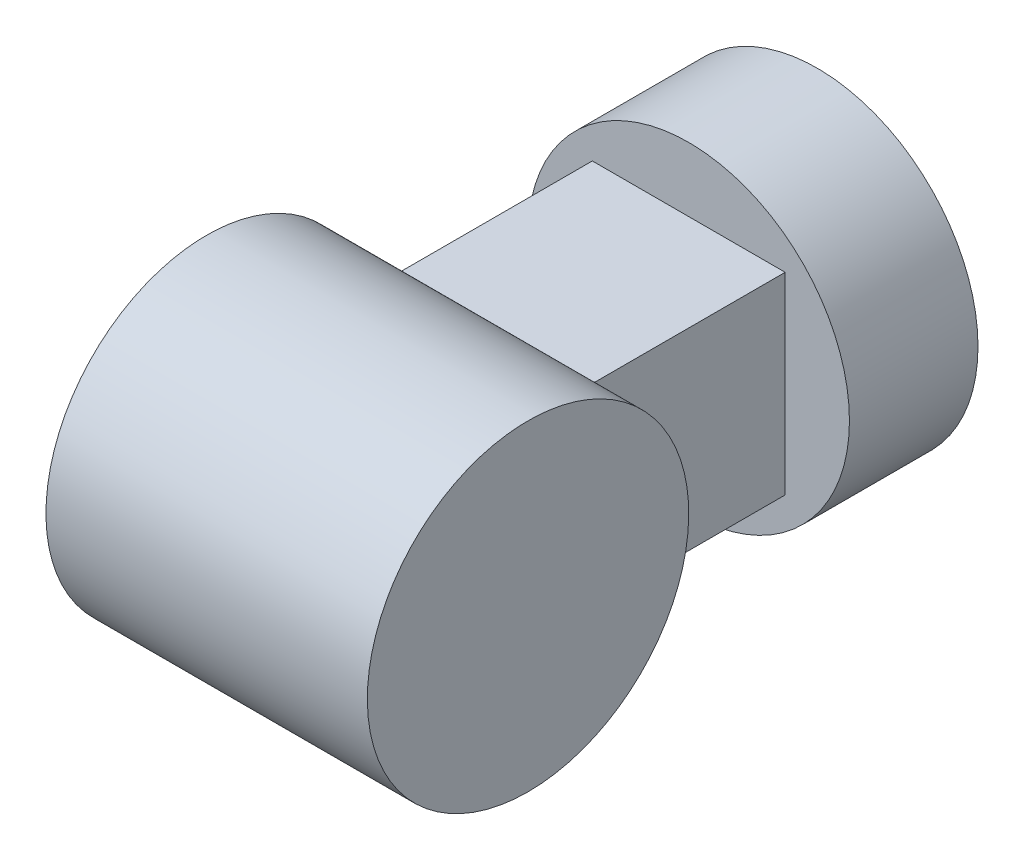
ISO-10303-21;
HEADER;
FILE_DESCRIPTION(('STEP AP214'),'2;1');
FILE_NAME('part.step','',(''),(''),'','','');
FILE_SCHEMA(('AUTOMOTIVE_DESIGN { 1 0 10303 214 1 1 1 1 }'));
ENDSEC;
DATA;
#1=APPLICATION_CONTEXT('core data for automotive mechanical design processes');
#2=APPLICATION_PROTOCOL_DEFINITION('international standard','automotive_design',2000,#1);
#3=PRODUCT_CONTEXT('',#1,'mechanical');
#4=PRODUCT('Part','Part','',(#3));
#5=PRODUCT_RELATED_PRODUCT_CATEGORY('part','',(#4));
#6=PRODUCT_DEFINITION_FORMATION('','',#4);
#7=PRODUCT_DEFINITION_CONTEXT('part definition',#1,'design');
#8=PRODUCT_DEFINITION('design','',#6,#7);
#9=PRODUCT_DEFINITION_SHAPE('','',#8);
#10=(LENGTH_UNIT() NAMED_UNIT(*) SI_UNIT(.MILLI.,.METRE.));
#11=(NAMED_UNIT(*) PLANE_ANGLE_UNIT() SI_UNIT($,.RADIAN.));
#12=(NAMED_UNIT(*) SI_UNIT($,.STERADIAN.) SOLID_ANGLE_UNIT());
#13=UNCERTAINTY_MEASURE_WITH_UNIT(LENGTH_MEASURE(1.E-05),#10,'distance_accuracy_value','');
#14=(GEOMETRIC_REPRESENTATION_CONTEXT(3) GLOBAL_UNCERTAINTY_ASSIGNED_CONTEXT((#13)) GLOBAL_UNIT_ASSIGNED_CONTEXT((#10,
#11,#12)) REPRESENTATION_CONTEXT('',''));
#15=CARTESIAN_POINT('',(0.,0.,0.));
#16=DIRECTION('',(0.,0.,1.));
#17=DIRECTION('',(1.,0.,0.));
#18=AXIS2_PLACEMENT_3D('',#15,#16,#17);
#19=CARTESIAN_POINT('',(0.,0.,100.));
#20=DIRECTION('',(0.,0.,-1.));
#21=DIRECTION('',(-1.,0.,0.));
#22=AXIS2_PLACEMENT_3D('',#19,#20,#21);
#23=CYLINDRICAL_SURFACE('',#22,125.);
#24=CARTESIAN_POINT('',(0.,0.,100.));
#25=DIRECTION('',(0.,0.,1.));
#26=DIRECTION('',(1.,0.,0.));
#27=AXIS2_PLACEMENT_3D('',#24,#25,#26);
#28=CIRCLE('',#27,125.);
#29=CARTESIAN_POINT('',(125.,0.,100.));
#30=VERTEX_POINT('',#29);
#31=EDGE_CURVE('E44',#30,#30,#28,.T.);
#32=ORIENTED_EDGE('',*,*,#31,.F.);
#33=EDGE_LOOP('',(#32));
#34=FACE_BOUND('',#33,.T.);
#35=CARTESIAN_POINT('',(0.,0.,0.));
#36=DIRECTION('',(0.,0.,1.));
#37=DIRECTION('',(1.,0.,0.));
#38=AXIS2_PLACEMENT_3D('',#35,#36,#37);
#39=CIRCLE('',#38,125.);
#40=CARTESIAN_POINT('',(125.,0.,0.));
#41=VERTEX_POINT('',#40);
#42=EDGE_CURVE('E100',#41,#41,#39,.T.);
#43=ORIENTED_EDGE('',*,*,#42,.T.);
#44=EDGE_LOOP('',(#43));
#45=FACE_BOUND('',#44,.T.);
#46=ADVANCED_FACE('F37',(#34,#45),#23,.T.);
#47=CARTESIAN_POINT('',(0.,0.,100.));
#48=DIRECTION('',(0.,0.,1.));
#49=DIRECTION('',(1.,0.,0.));
#50=AXIS2_PLACEMENT_3D('',#47,#48,#49);
#51=PLANE('',#50);
#52=DIRECTION('',(0.,1.,0.));
#53=VECTOR('',#52,1.);
#54=CARTESIAN_POINT('',(75.,-75.,100.));
#55=LINE('',#54,#53);
#56=CARTESIAN_POINT('',(75.,-75.,100.));
#57=VERTEX_POINT('',#56);
#58=CARTESIAN_POINT('',(75.,75.,100.));
#59=VERTEX_POINT('',#58);
#60=EDGE_CURVE('E83',#57,#59,#55,.T.);
#61=ORIENTED_EDGE('',*,*,#60,.F.);
#62=DIRECTION('',(1.,0.,0.));
#63=VECTOR('',#62,1.);
#64=CARTESIAN_POINT('',(75.,-75.,100.));
#65=LINE('',#64,#63);
#66=CARTESIAN_POINT('',(-75.,-75.,100.));
#67=VERTEX_POINT('',#66);
#68=EDGE_CURVE('E89',#67,#57,#65,.T.);
#69=ORIENTED_EDGE('',*,*,#68,.F.);
#70=DIRECTION('',(0.,-1.,0.));
#71=VECTOR('',#70,1.);
#72=CARTESIAN_POINT('',(-75.,-75.,100.));
#73=LINE('',#72,#71);
#74=CARTESIAN_POINT('',(-75.,75.,100.));
#75=VERTEX_POINT('',#74);
#76=EDGE_CURVE('E94',#75,#67,#73,.T.);
#77=ORIENTED_EDGE('',*,*,#76,.F.);
#78=DIRECTION('',(-1.,0.,0.));
#79=VECTOR('',#78,1.);
#80=CARTESIAN_POINT('',(75.,75.,100.));
#81=LINE('',#80,#79);
#82=EDGE_CURVE('E206',#59,#75,#81,.T.);
#83=ORIENTED_EDGE('',*,*,#82,.F.);
#84=EDGE_LOOP('',(#61,#69,#77,#83));
#85=FACE_BOUND('',#84,.T.);
#86=ORIENTED_EDGE('',*,*,#31,.T.);
#87=EDGE_LOOP('',(#86));
#88=FACE_BOUND('',#87,.T.);
#89=ADVANCED_FACE('F108',(#85,#88),#51,.T.);
#90=CARTESIAN_POINT('',(0.,0.,0.));
#91=DIRECTION('',(0.,0.,1.));
#92=DIRECTION('',(1.,0.,0.));
#93=AXIS2_PLACEMENT_3D('',#90,#91,#92);
#94=PLANE('',#93);
#95=ORIENTED_EDGE('',*,*,#42,.F.);
#96=EDGE_LOOP('',(#95));
#97=FACE_BOUND('',#96,.T.);
#98=ADVANCED_FACE('F106',(#97),#94,.F.);
#99=CARTESIAN_POINT('',(75.,-75.,350.));
#100=DIRECTION('',(-1.,0.,0.));
#101=DIRECTION('',(0.,0.,1.));
#102=AXIS2_PLACEMENT_3D('',#99,#100,#101);
#103=PLANE('',#102);
#104=DIRECTION('',(0.,0.,-1.));
#105=VECTOR('',#104,1.);
#106=CARTESIAN_POINT('',(75.,75.,350.));
#107=LINE('',#106,#105);
#108=CARTESIAN_POINT('',(75.,75.,250.));
#109=VERTEX_POINT('',#108);
#110=EDGE_CURVE('E82',#109,#59,#107,.T.);
#111=ORIENTED_EDGE('',*,*,#110,.F.);
#112=CARTESIAN_POINT('',(75.,0.,350.));
#113=DIRECTION('',(-1.,0.,0.));
#114=DIRECTION('',(0.,0.,1.));
#115=AXIS2_PLACEMENT_3D('',#112,#113,#114);
#116=CIRCLE('',#115,125.);
#117=CARTESIAN_POINT('',(75.,-75.,250.));
#118=VERTEX_POINT('',#117);
#119=EDGE_CURVE('E76',#109,#118,#116,.T.);
#120=ORIENTED_EDGE('',*,*,#119,.T.);
#121=DIRECTION('',(0.,0.,-1.));
#122=VECTOR('',#121,1.);
#123=CARTESIAN_POINT('',(75.,-75.,350.));
#124=LINE('',#123,#122);
#125=EDGE_CURVE('E58',#118,#57,#124,.T.);
#126=ORIENTED_EDGE('',*,*,#125,.T.);
#127=ORIENTED_EDGE('',*,*,#60,.T.);
#128=EDGE_LOOP('',(#111,#120,#126,#127));
#129=FACE_BOUND('',#128,.T.);
#130=ADVANCED_FACE('F81',(#129),#103,.F.);
#131=CARTESIAN_POINT('',(75.,75.,350.));
#132=DIRECTION('',(0.,-1.,0.));
#133=DIRECTION('',(1.,0.,0.));
#134=AXIS2_PLACEMENT_3D('',#131,#132,#133);
#135=PLANE('',#134);
#136=DIRECTION('',(0.,0.,-1.));
#137=VECTOR('',#136,1.);
#138=CARTESIAN_POINT('',(-75.,75.,350.));
#139=LINE('',#138,#137);
#140=CARTESIAN_POINT('',(-75.,75.,250.));
#141=VERTEX_POINT('',#140);
#142=EDGE_CURVE('E92',#141,#75,#139,.T.);
#143=ORIENTED_EDGE('',*,*,#142,.F.);
#144=DIRECTION('',(-1.,0.,0.));
#145=VECTOR('',#144,1.);
#146=CARTESIAN_POINT('',(125.,75.,250.));
#147=LINE('',#146,#145);
#148=EDGE_CURVE('E84',#141,#109,#147,.F.);
#149=ORIENTED_EDGE('',*,*,#148,.T.);
#150=ORIENTED_EDGE('',*,*,#110,.T.);
#151=ORIENTED_EDGE('',*,*,#82,.T.);
#152=EDGE_LOOP('',(#143,#149,#150,#151));
#153=FACE_BOUND('',#152,.T.);
#154=ADVANCED_FACE('F113',(#153),#135,.F.);
#155=CARTESIAN_POINT('',(-75.,-75.,350.));
#156=DIRECTION('',(1.,0.,0.));
#157=DIRECTION('',(0.,1.,0.));
#158=AXIS2_PLACEMENT_3D('',#155,#156,#157);
#159=PLANE('',#158);
#160=DIRECTION('',(0.,0.,-1.));
#161=VECTOR('',#160,1.);
#162=CARTESIAN_POINT('',(-75.,-75.,350.));
#163=LINE('',#162,#161);
#164=CARTESIAN_POINT('',(-75.,-75.,250.));
#165=VERTEX_POINT('',#164);
#166=EDGE_CURVE('E90',#165,#67,#163,.T.);
#167=ORIENTED_EDGE('',*,*,#166,.F.);
#168=CARTESIAN_POINT('',(-75.,0.,350.));
#169=DIRECTION('',(1.,0.,0.));
#170=DIRECTION('',(0.,1.,0.));
#171=AXIS2_PLACEMENT_3D('',#168,#169,#170);
#172=CIRCLE('',#171,125.);
#173=EDGE_CURVE('E51',#165,#141,#172,.T.);
#174=ORIENTED_EDGE('',*,*,#173,.T.);
#175=ORIENTED_EDGE('',*,*,#142,.T.);
#176=ORIENTED_EDGE('',*,*,#76,.T.);
#177=EDGE_LOOP('',(#167,#174,#175,#176));
#178=FACE_BOUND('',#177,.T.);
#179=ADVANCED_FACE('F144',(#178),#159,.F.);
#180=CARTESIAN_POINT('',(75.,-75.,350.));
#181=DIRECTION('',(0.,1.,0.));
#182=DIRECTION('',(-1.,0.,0.));
#183=AXIS2_PLACEMENT_3D('',#180,#181,#182);
#184=PLANE('',#183);
#185=ORIENTED_EDGE('',*,*,#125,.F.);
#186=DIRECTION('',(-1.,0.,0.));
#187=VECTOR('',#186,1.);
#188=CARTESIAN_POINT('',(125.,-75.,250.));
#189=LINE('',#188,#187);
#190=EDGE_CURVE('E11',#118,#165,#189,.T.);
#191=ORIENTED_EDGE('',*,*,#190,.T.);
#192=ORIENTED_EDGE('',*,*,#166,.T.);
#193=ORIENTED_EDGE('',*,*,#68,.T.);
#194=EDGE_LOOP('',(#185,#191,#192,#193));
#195=FACE_BOUND('',#194,.T.);
#196=ADVANCED_FACE('F87',(#195),#184,.F.);
#197=CARTESIAN_POINT('',(125.,0.,350.));
#198=DIRECTION('',(-1.,0.,0.));
#199=DIRECTION('',(0.,-1.,0.));
#200=AXIS2_PLACEMENT_3D('',#197,#198,#199);
#201=CYLINDRICAL_SURFACE('',#200,125.);
#202=CARTESIAN_POINT('',(-125.,0.,350.));
#203=DIRECTION('',(-1.,0.,0.));
#204=DIRECTION('',(0.,-1.,0.));
#205=AXIS2_PLACEMENT_3D('',#202,#203,#204);
#206=CIRCLE('',#205,125.);
#207=CARTESIAN_POINT('',(-125.,-125.,350.));
#208=VERTEX_POINT('',#207);
#209=EDGE_CURVE('E197',#208,#208,#206,.T.);
#210=ORIENTED_EDGE('',*,*,#209,.F.);
#211=EDGE_LOOP('',(#210));
#212=FACE_BOUND('',#211,.T.);
#213=CARTESIAN_POINT('',(125.,0.,350.));
#214=DIRECTION('',(-1.,0.,0.));
#215=DIRECTION('',(0.,-1.,0.));
#216=AXIS2_PLACEMENT_3D('',#213,#214,#215);
#217=CIRCLE('',#216,125.);
#218=CARTESIAN_POINT('',(125.,-125.,350.));
#219=VERTEX_POINT('',#218);
#220=EDGE_CURVE('E198',#219,#219,#217,.T.);
#221=ORIENTED_EDGE('',*,*,#220,.T.);
#222=EDGE_LOOP('',(#221));
#223=FACE_BOUND('',#222,.T.);
#224=ORIENTED_EDGE('',*,*,#119,.F.);
#225=ORIENTED_EDGE('',*,*,#148,.F.);
#226=ORIENTED_EDGE('',*,*,#173,.F.);
#227=ORIENTED_EDGE('',*,*,#190,.F.);
#228=EDGE_LOOP('',(#224,#225,#226,#227));
#229=FACE_BOUND('',#228,.T.);
#230=ADVANCED_FACE('F75',(#212,#223,#229),#201,.T.);
#231=CARTESIAN_POINT('',(125.,0.,350.));
#232=DIRECTION('',(-1.,0.,0.));
#233=DIRECTION('',(0.,-1.,0.));
#234=AXIS2_PLACEMENT_3D('',#231,#232,#233);
#235=PLANE('',#234);
#236=ORIENTED_EDGE('',*,*,#220,.F.);
#237=EDGE_LOOP('',(#236));
#238=FACE_BOUND('',#237,.T.);
#239=ADVANCED_FACE('F171',(#238),#235,.F.);
#240=CARTESIAN_POINT('',(-125.,0.,350.));
#241=DIRECTION('',(-1.,0.,0.));
#242=DIRECTION('',(0.,-1.,0.));
#243=AXIS2_PLACEMENT_3D('',#240,#241,#242);
#244=PLANE('',#243);
#245=ORIENTED_EDGE('',*,*,#209,.T.);
#246=EDGE_LOOP('',(#245));
#247=FACE_BOUND('',#246,.T.);
#248=ADVANCED_FACE('F181',(#247),#244,.T.);
#249=CLOSED_SHELL('',(#46,#89,#98,#130,#154,#179,#196,#230,#239,#248));
#250=MANIFOLD_SOLID_BREP('B2',#249);
#251=ADVANCED_BREP_SHAPE_REPRESENTATION('',(#18,#250),#14);
#252=SHAPE_DEFINITION_REPRESENTATION(#9,#251);
ENDSEC;
END-ISO-10303-21;
